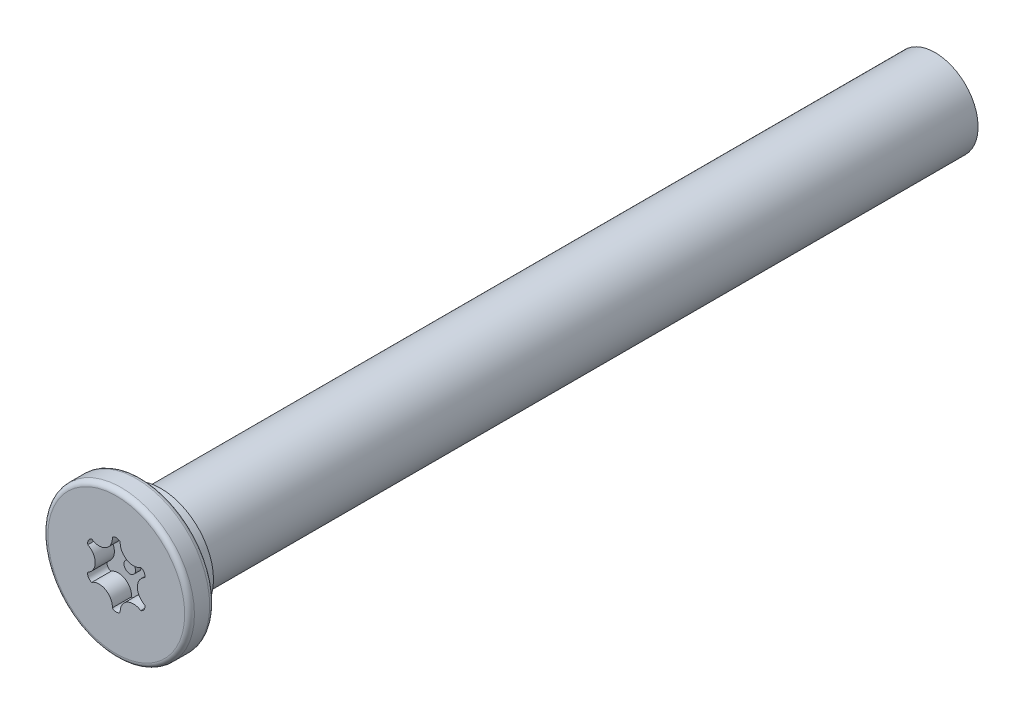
from build123d import *

# Parameters (mm, degrees)
SKETCH2_W           = 1.3
SKETCH2_H           = 3.81
SKETCH2_W_2         = 12.7
SKETCH2_H_2         = 2.23
CUT_EXTRUDE3_DEPTH  = 1
FILLET12_R          = 0.254
CUT_EXTRUDE6_START  = -12.7
SKETCH7_R           = 2.23
CUT_EXTRUDE6_DEPTH  = 12.7
SKETCH11_R          = 2.738000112
SKETCH11_R_2        = 2.230000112
BOSS_EXTRUDE1_DEPTH = 1.016
SKETCH12_R          = 2.230000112
BOSS_EXTRUDE2_DEPTH = 12.7
SKETCH14_R          = 0.3
BOSS_EXTRUDE4_DEPTH = 0.3
CUT_EXTRUDE7_START  = -12.7
SKETCH15_R          = 2.230000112
CUT_EXTRUDE7_DEPTH  = 12.7
SKETCH16_R          = 2.230000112
BOSS_EXTRUDE5_DEPTH = 41.275


with BuildPart() as part:
    # Sketch2 → Revolve1 (revolve)
    with BuildSketch(Plane(origin=(0, 0, 0), x_dir=(0, 0, -1), z_dir=(1, 0, 0)), mode=Mode.PRIVATE) as revolve1_sk:
        with Locations((0.65, 1.905)):
            Rectangle(SKETCH2_W, SKETCH2_H)
        with Locations((7.65, 1.115)):
            Rectangle(SKETCH2_W_2, SKETCH2_H_2)
    revolve(revolve1_sk.sketch.rotate(Axis((0, 0, -1.3), (0, 0, -1)), 90), axis=Axis((0, 0, -1.3), (0, 0, -1)))

    # Sketch3 → Cut-Extrude3 (cut)
    with BuildSketch(Plane.XY):
        with BuildLine():
            ThreePointArc((-0.205060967, 1.589373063), (0, 1.674312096), (0.205060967, 1.589373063))
            ThreePointArc((0.205060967, 1.589373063), (0.54882888, 0.950599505), (1.273906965, 0.972274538))
            ThreePointArc((1.273906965, 0.972274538), (1.449996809, 0.837156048), (1.478967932, 0.617098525))
            ThreePointArc((1.478967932, 0.617098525), (1.097657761, 0), (1.478967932, -0.617098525))
            ThreePointArc((1.478967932, -0.617098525), (1.449996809, -0.837156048), (1.273906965, -0.972274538))
            ThreePointArc((1.273906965, -0.972274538), (0.54882888, -0.950599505), (0.205060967, -1.589373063))
            ThreePointArc((0.205060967, -1.589373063), (0, -1.674312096), (-0.205060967, -1.589373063))
            ThreePointArc((-0.205060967, -1.589373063), (-0.54882888, -0.950599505), (-1.273906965, -0.972274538))
            ThreePointArc((-1.273906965, -0.972274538), (-1.449996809, -0.837156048), (-1.478967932, -0.617098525))
            ThreePointArc((-1.478967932, -0.617098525), (-1.097657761, 0), (-1.478967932, 0.617098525))
            ThreePointArc((-1.478967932, 0.617098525), (-1.449996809, 0.837156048), (-1.273906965, 0.972274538))
            ThreePointArc((-1.273906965, 0.972274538), (-0.54882888, 0.950599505), (-0.205060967, 1.589373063))
        make_face()
    extrude(amount=-CUT_EXTRUDE3_DEPTH, mode=Mode.SUBTRACT)

    # Fillet12
    fillet12_edges = [part.edges().sort_by_distance(p)[0] for p in [
        (-3.81, 0, 0),
        (-3.81, 0, -1.3),
    ]]
    fillet(fillet12_edges, radius=FILLET12_R)

    # Sketch7 → Cut-Extrude6 (cut)
    with BuildSketch(Plane(origin=(0, 0, -14), x_dir=(-1, 0, 0), z_dir=(0, 0, -1)).offset(CUT_EXTRUDE6_START)):
        Circle(SKETCH7_R)
    extrude(amount=CUT_EXTRUDE6_DEPTH, mode=Mode.SUBTRACT)

    # Sketch11 → Boss-Extrude1 (add)
    with BuildSketch(Plane(origin=(0, 0, -1.3), x_dir=(-1, 0, 0), z_dir=(0, 0, -1))):
        with Locations(Location((0, 0, 0), (0, 0, 180))):
            Circle(SKETCH11_R)
        Circle(SKETCH11_R_2, mode=Mode.SUBTRACT)
    extrude(amount=BOSS_EXTRUDE1_DEPTH)

    # Sketch12 → Boss-Extrude2 (add)
    with BuildSketch(Plane(origin=(0, 0, -1.3), x_dir=(-1, 0, 0), z_dir=(0, 0, -1))):
        Circle(SKETCH12_R)
    extrude(amount=BOSS_EXTRUDE2_DEPTH)

    # Sketch14 → Boss-Extrude4 (add)
    with BuildSketch(Plane.XY.offset(-1)):
        Circle(SKETCH14_R)
    extrude(amount=BOSS_EXTRUDE4_DEPTH)

    # Sketch15 → Cut-Extrude7 (cut)
    with BuildSketch(Plane(origin=(0, 0, -14), x_dir=(-1, 0, 0), z_dir=(0, 0, -1)).offset(CUT_EXTRUDE7_START)):
        Circle(SKETCH15_R)
    extrude(amount=CUT_EXTRUDE7_DEPTH, mode=Mode.SUBTRACT)

    # Sketch16 → Boss-Extrude5 (add)
    with BuildSketch(Plane(origin=(0, 0, -1.3), x_dir=(-1, 0, 0), z_dir=(0, 0, -1))):
        Circle(SKETCH16_R)
    extrude(amount=BOSS_EXTRUDE5_DEPTH)


solid = part.part
